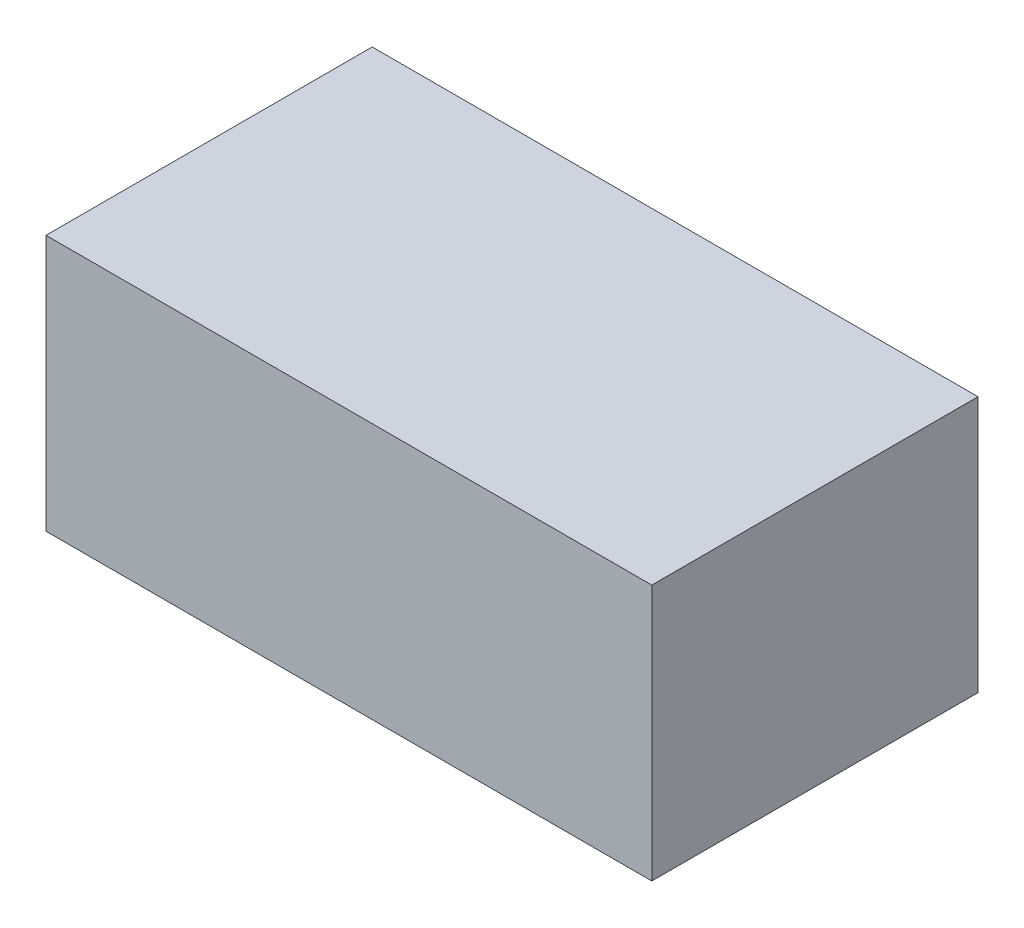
ISO-10303-21;
HEADER;
FILE_DESCRIPTION(('STEP AP214'),'2;1');
FILE_NAME('part.step','',(''),(''),'','','');
FILE_SCHEMA(('AUTOMOTIVE_DESIGN { 1 0 10303 214 1 1 1 1 }'));
ENDSEC;
DATA;
#1=APPLICATION_CONTEXT('core data for automotive mechanical design processes');
#2=APPLICATION_PROTOCOL_DEFINITION('international standard','automotive_design',2000,#1);
#3=PRODUCT_CONTEXT('',#1,'mechanical');
#4=PRODUCT('Part','Part','',(#3));
#5=PRODUCT_RELATED_PRODUCT_CATEGORY('part','',(#4));
#6=PRODUCT_DEFINITION_FORMATION('','',#4);
#7=PRODUCT_DEFINITION_CONTEXT('part definition',#1,'design');
#8=PRODUCT_DEFINITION('design','',#6,#7);
#9=PRODUCT_DEFINITION_SHAPE('','',#8);
#10=(LENGTH_UNIT() NAMED_UNIT(*) SI_UNIT(.MILLI.,.METRE.));
#11=(NAMED_UNIT(*) PLANE_ANGLE_UNIT() SI_UNIT($,.RADIAN.));
#12=(NAMED_UNIT(*) SI_UNIT($,.STERADIAN.) SOLID_ANGLE_UNIT());
#13=UNCERTAINTY_MEASURE_WITH_UNIT(LENGTH_MEASURE(1.E-05),#10,'distance_accuracy_value','');
#14=(GEOMETRIC_REPRESENTATION_CONTEXT(3) GLOBAL_UNCERTAINTY_ASSIGNED_CONTEXT((#13)) GLOBAL_UNIT_ASSIGNED_CONTEXT((#10,
#11,#12)) REPRESENTATION_CONTEXT('',''));
#15=CARTESIAN_POINT('',(0.,0.,0.));
#16=DIRECTION('',(0.,0.,1.));
#17=DIRECTION('',(1.,0.,0.));
#18=AXIS2_PLACEMENT_3D('',#15,#16,#17);
#19=CARTESIAN_POINT('',(13.,11.,-7.));
#20=DIRECTION('',(-1.,0.,0.));
#21=DIRECTION('',(0.,0.,1.));
#22=AXIS2_PLACEMENT_3D('',#19,#20,#21);
#23=PLANE('',#22);
#24=DIRECTION('',(0.,0.,-1.));
#25=VECTOR('',#24,1.);
#26=CARTESIAN_POINT('',(13.,0.,-7.));
#27=LINE('',#26,#25);
#28=CARTESIAN_POINT('',(13.,0.,7.));
#29=VERTEX_POINT('',#28);
#30=CARTESIAN_POINT('',(13.,0.,-7.));
#31=VERTEX_POINT('',#30);
#32=EDGE_CURVE('E98',#29,#31,#27,.T.);
#33=ORIENTED_EDGE('',*,*,#32,.T.);
#34=DIRECTION('',(0.,-1.,0.));
#35=VECTOR('',#34,1.);
#36=CARTESIAN_POINT('',(13.,11.,-7.));
#37=LINE('',#36,#35);
#38=CARTESIAN_POINT('',(13.,11.,-7.));
#39=VERTEX_POINT('',#38);
#40=EDGE_CURVE('E11',#39,#31,#37,.T.);
#41=ORIENTED_EDGE('',*,*,#40,.F.);
#42=DIRECTION('',(0.,0.,-1.));
#43=VECTOR('',#42,1.);
#44=CARTESIAN_POINT('',(13.,11.,-7.));
#45=LINE('',#44,#43);
#46=CARTESIAN_POINT('',(13.,11.,7.));
#47=VERTEX_POINT('',#46);
#48=EDGE_CURVE('E86',#47,#39,#45,.T.);
#49=ORIENTED_EDGE('',*,*,#48,.F.);
#50=DIRECTION('',(0.,-1.,0.));
#51=VECTOR('',#50,1.);
#52=CARTESIAN_POINT('',(13.,11.,7.));
#53=LINE('',#52,#51);
#54=EDGE_CURVE('E94',#47,#29,#53,.T.);
#55=ORIENTED_EDGE('',*,*,#54,.T.);
#56=EDGE_LOOP('',(#33,#41,#49,#55));
#57=FACE_BOUND('',#56,.T.);
#58=ADVANCED_FACE('F35',(#57),#23,.F.);
#59=CARTESIAN_POINT('',(-13.,11.,-7.));
#60=DIRECTION('',(0.,0.,1.));
#61=DIRECTION('',(1.,0.,0.));
#62=AXIS2_PLACEMENT_3D('',#59,#60,#61);
#63=PLANE('',#62);
#64=DIRECTION('',(-1.,0.,0.));
#65=VECTOR('',#64,1.);
#66=CARTESIAN_POINT('',(-13.,0.,-7.));
#67=LINE('',#66,#65);
#68=CARTESIAN_POINT('',(-13.,0.,-7.));
#69=VERTEX_POINT('',#68);
#70=EDGE_CURVE('E90',#31,#69,#67,.T.);
#71=ORIENTED_EDGE('',*,*,#70,.T.);
#72=DIRECTION('',(0.,-1.,0.));
#73=VECTOR('',#72,1.);
#74=CARTESIAN_POINT('',(-13.,11.,-7.));
#75=LINE('',#74,#73);
#76=CARTESIAN_POINT('',(-13.,11.,-7.));
#77=VERTEX_POINT('',#76);
#78=EDGE_CURVE('E43',#77,#69,#75,.T.);
#79=ORIENTED_EDGE('',*,*,#78,.F.);
#80=DIRECTION('',(-1.,0.,0.));
#81=VECTOR('',#80,1.);
#82=CARTESIAN_POINT('',(-13.,11.,-7.));
#83=LINE('',#82,#81);
#84=EDGE_CURVE('E81',#39,#77,#83,.T.);
#85=ORIENTED_EDGE('',*,*,#84,.F.);
#86=ORIENTED_EDGE('',*,*,#40,.T.);
#87=EDGE_LOOP('',(#71,#79,#85,#86));
#88=FACE_BOUND('',#87,.T.);
#89=ADVANCED_FACE('F89',(#88),#63,.F.);
#90=CARTESIAN_POINT('',(-13.,11.,-7.));
#91=DIRECTION('',(1.,0.,0.));
#92=DIRECTION('',(0.,0.,-1.));
#93=AXIS2_PLACEMENT_3D('',#90,#91,#92);
#94=PLANE('',#93);
#95=DIRECTION('',(0.,0.,1.));
#96=VECTOR('',#95,1.);
#97=CARTESIAN_POINT('',(-13.,0.,-7.));
#98=LINE('',#97,#96);
#99=CARTESIAN_POINT('',(-13.,0.,7.));
#100=VERTEX_POINT('',#99);
#101=EDGE_CURVE('E68',#69,#100,#98,.T.);
#102=ORIENTED_EDGE('',*,*,#101,.T.);
#103=DIRECTION('',(0.,-1.,0.));
#104=VECTOR('',#103,1.);
#105=CARTESIAN_POINT('',(-13.,11.,7.));
#106=LINE('',#105,#104);
#107=CARTESIAN_POINT('',(-13.,11.,7.));
#108=VERTEX_POINT('',#107);
#109=EDGE_CURVE('E91',#108,#100,#106,.T.);
#110=ORIENTED_EDGE('',*,*,#109,.F.);
#111=DIRECTION('',(0.,0.,1.));
#112=VECTOR('',#111,1.);
#113=CARTESIAN_POINT('',(-13.,11.,-7.));
#114=LINE('',#113,#112);
#115=EDGE_CURVE('E84',#77,#108,#114,.T.);
#116=ORIENTED_EDGE('',*,*,#115,.F.);
#117=ORIENTED_EDGE('',*,*,#78,.T.);
#118=EDGE_LOOP('',(#102,#110,#116,#117));
#119=FACE_BOUND('',#118,.T.);
#120=ADVANCED_FACE('F92',(#119),#94,.F.);
#121=CARTESIAN_POINT('',(-13.,11.,7.));
#122=DIRECTION('',(0.,0.,-1.));
#123=DIRECTION('',(-1.,0.,0.));
#124=AXIS2_PLACEMENT_3D('',#121,#122,#123);
#125=PLANE('',#124);
#126=DIRECTION('',(1.,0.,0.));
#127=VECTOR('',#126,1.);
#128=CARTESIAN_POINT('',(-13.,0.,7.));
#129=LINE('',#128,#127);
#130=EDGE_CURVE('E74',#100,#29,#129,.T.);
#131=ORIENTED_EDGE('',*,*,#130,.T.);
#132=ORIENTED_EDGE('',*,*,#54,.F.);
#133=DIRECTION('',(1.,0.,0.));
#134=VECTOR('',#133,1.);
#135=CARTESIAN_POINT('',(-13.,11.,7.));
#136=LINE('',#135,#134);
#137=EDGE_CURVE('E51',#108,#47,#136,.T.);
#138=ORIENTED_EDGE('',*,*,#137,.F.);
#139=ORIENTED_EDGE('',*,*,#109,.T.);
#140=EDGE_LOOP('',(#131,#132,#138,#139));
#141=FACE_BOUND('',#140,.T.);
#142=ADVANCED_FACE('F105',(#141),#125,.F.);
#143=CARTESIAN_POINT('',(0.,11.,0.));
#144=DIRECTION('',(0.,1.,0.));
#145=DIRECTION('',(0.,0.,1.));
#146=AXIS2_PLACEMENT_3D('',#143,#144,#145);
#147=PLANE('',#146);
#148=ORIENTED_EDGE('',*,*,#48,.T.);
#149=ORIENTED_EDGE('',*,*,#84,.T.);
#150=ORIENTED_EDGE('',*,*,#115,.T.);
#151=ORIENTED_EDGE('',*,*,#137,.T.);
#152=EDGE_LOOP('',(#148,#149,#150,#151));
#153=FACE_BOUND('',#152,.T.);
#154=ADVANCED_FACE('F82',(#153),#147,.T.);
#155=CARTESIAN_POINT('',(0.,0.,0.));
#156=DIRECTION('',(0.,1.,0.));
#157=DIRECTION('',(0.,0.,1.));
#158=AXIS2_PLACEMENT_3D('',#155,#156,#157);
#159=PLANE('',#158);
#160=ORIENTED_EDGE('',*,*,#32,.F.);
#161=ORIENTED_EDGE('',*,*,#130,.F.);
#162=ORIENTED_EDGE('',*,*,#101,.F.);
#163=ORIENTED_EDGE('',*,*,#70,.F.);
#164=EDGE_LOOP('',(#160,#161,#162,#163));
#165=FACE_BOUND('',#164,.T.);
#166=ADVANCED_FACE('F108',(#165),#159,.F.);
#167=CLOSED_SHELL('',(#58,#89,#120,#142,#154,#166));
#168=MANIFOLD_SOLID_BREP('B2',#167);
#169=ADVANCED_BREP_SHAPE_REPRESENTATION('',(#18,#168),#14);
#170=SHAPE_DEFINITION_REPRESENTATION(#9,#169);
ENDSEC;
END-ISO-10303-21;
